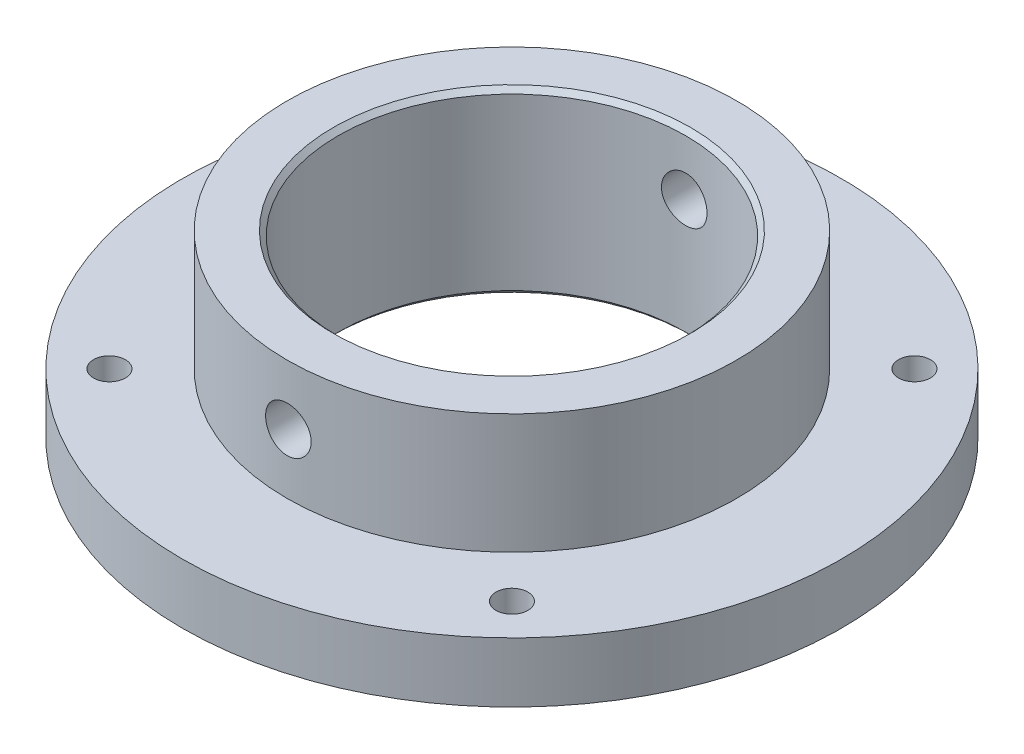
from build123d import *

# Parameters (mm, degrees)
CHAMFER1_SIZE      = 1.016
SKETCH2_R          = 4.826
CUT_EXTRUDE1_DEPTH = 48.26
SKETCH3_R          = 3.3782
CUT_EXTRUDE2_DEPTH = 106.875658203
CIRPATTERN1_COUNT  = 4


with BuildPart() as part:
    # Sketch1 → Revolve1 (revolve)
    with BuildSketch(Plane.XY, mode=Mode.PRIVATE) as revolve1_sk:
        Polygon((36.83, 0), (47.625, 0), (47.625, -25.4), (69.85, -25.4), (69.85, -38.1), (36.83, -38.1), align=None)
    revolve(revolve1_sk.sketch.rotate(Axis((0, 0, 0), (0, -1, 0)), 90), axis=Axis((0, 0, 0), (0, -1, 0)))

    # Chamfer1
    chamfer1_edges = [part.edges().sort_by_distance(p)[0] for p in [
        (0, 0, -36.83),
        (0, -38.1, -36.83),
    ]]
    chamfer(chamfer1_edges, length=CHAMFER1_SIZE)

    # Sketch2 → Cut-Extrude1 (cut, symmetric)
    with BuildSketch(Plane.XY):
        with Locations((0, -12.7)):
            Circle(SKETCH2_R)
    extrude(amount=CUT_EXTRUDE1_DEPTH, both=True, mode=Mode.SUBTRACT)

    # Sketch3 → Cut-Extrude2 (cut, through all)
    with BuildSketch(Plane(origin=(0, 0, 0), x_dir=(1, 0, 0), z_dir=(0, 1, 0))):
        with Locations(Location((-42.656216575, 42.656216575, 0), (0, 0, 270))):
            Circle(SKETCH3_R)
    cut_extrude2 = extrude(amount=-CUT_EXTRUDE2_DEPTH, mode=Mode.SUBTRACT)

    # CirPattern1: Cut-Extrude2 ×4 about axis
    cirpattern1_axis = Axis((0, 0, 0), (0, 1, 0))
    for i in range(1, CIRPATTERN1_COUNT):
        add(cut_extrude2.rotate(cirpattern1_axis, i * 360 / CIRPATTERN1_COUNT), mode=Mode.SUBTRACT)


solid = part.part
